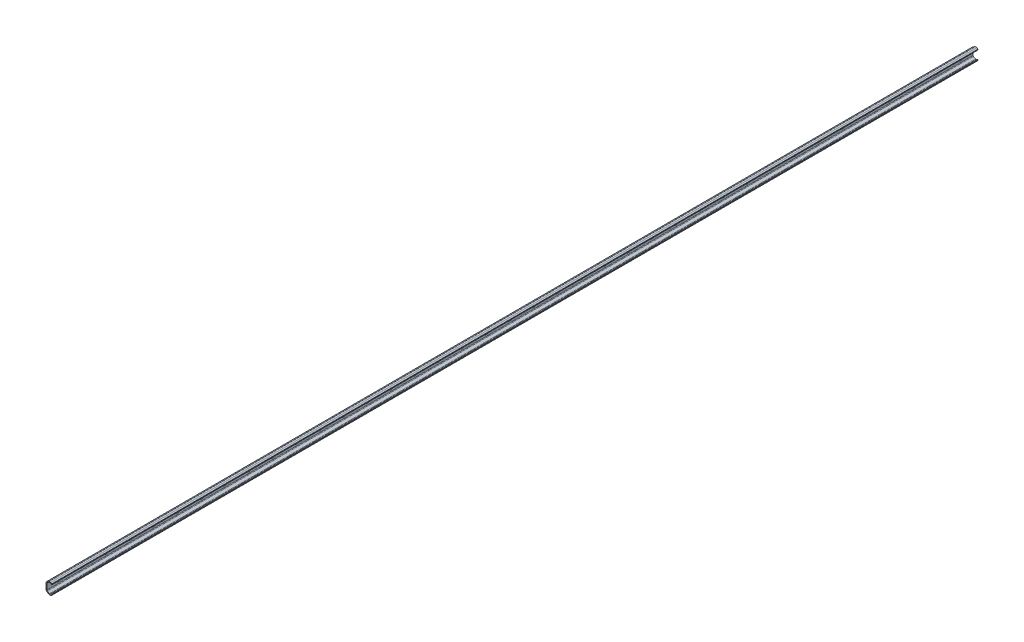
from build123d import *

# Parameters (mm, degrees)
BOSS_EXTRUDE1_DEPTH = 3120
CUT_EXTRUDE1_DEPTH  = 3121.10891087
LPATTERN1_COUNT     = 39
LPATTERN1_PITCH     = 80


with BuildPart() as part:
    # Sketch1 → Boss-Extrude1 (new body)
    with BuildSketch(Plane.XY):
        with BuildLine():
            Line((19.499613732, 13.474805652), (19.999997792, 14.341496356))
            Line((19.999997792, 14.341496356), (19.999997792, 16.649985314))
            Line((19.999997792, 16.649985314), (16.076193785, 18.915394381))
            ThreePointArc((16.076193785, 18.915394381), (13.043994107, 19.73984446), (9.999984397, 18.960128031))
            Line((9.999984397, 18.960128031), (2.999981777, 14.918641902))
            ThreePointArc((2.999981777, 14.918641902), (0.803842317, 12.722490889), (0, 9.7225))
            Line((0, 9.7225), (0, 0))
            Line((0, 0), (0, -9.7225))
            ThreePointArc((0, -9.7225), (0.803842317, -12.722490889), (2.999981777, -14.918641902))
            Line((2.999981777, -14.918641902), (9.999984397, -18.960128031))
            ThreePointArc((9.999984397, -18.960128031), (13.044170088, -19.763823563), (16.076193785, -18.915398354))
            Line((16.076193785, -18.915398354), (19.999997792, -16.649989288))
            Line((19.999997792, -16.649989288), (19.999997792, -14.34150033))
            Line((19.999997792, -14.34150033), (19.499613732, -13.474809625))
            Line((19.499613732, -13.474809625), (14.553790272, -16.330281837))
            ThreePointArc((14.553790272, -16.330281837), (13.031057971, -16.746803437), (11.499984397, -16.362072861))
            Line((11.499984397, -16.362072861), (4.499981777, -12.320586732))
            ThreePointArc((4.499981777, -12.320586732), (3.401905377, -11.222504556), (2.999981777, -9.7225))
            Line((2.999981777, -9.7225), (2.999981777, 9.7225))
            ThreePointArc((2.999981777, 9.7225), (3.401905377, 11.222504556), (4.499981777, 12.320586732))
            Line((4.499981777, 12.320586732), (11.499984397, 16.362072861))
            ThreePointArc((11.499984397, 16.362072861), (13.031235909, 16.763841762), (14.553790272, 16.330277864))
            Line((14.553790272, 16.330277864), (19.499613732, 13.474805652))
        make_face()
    extrude(amount=-BOSS_EXTRUDE1_DEPTH)

    # Sketch2 → Cut-Extrude1 (cut, through all)
    with BuildSketch(Plane(origin=(2.999981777, 0, 0), x_dir=(0, 0, -1), z_dir=(1, 0, 0))):
        with BuildLine():
            Line((42, -4.5), (38, -4.5))
            ThreePointArc((38, -4.5), (33.5, 0), (38, 4.5))
            Line((38, 4.5), (42, 4.5))
            ThreePointArc((42, 4.5), (46.5, 0), (42, -4.5))
        make_face()
    cut_extrude1 = extrude(amount=-CUT_EXTRUDE1_DEPTH, mode=Mode.SUBTRACT)

    # LPattern1: Cut-Extrude1 ×39
    with Locations(*[(0, 0, -i * LPATTERN1_PITCH) for i in range(1, LPATTERN1_COUNT)]):
        add(cut_extrude1, mode=Mode.SUBTRACT)


solid = part.part
